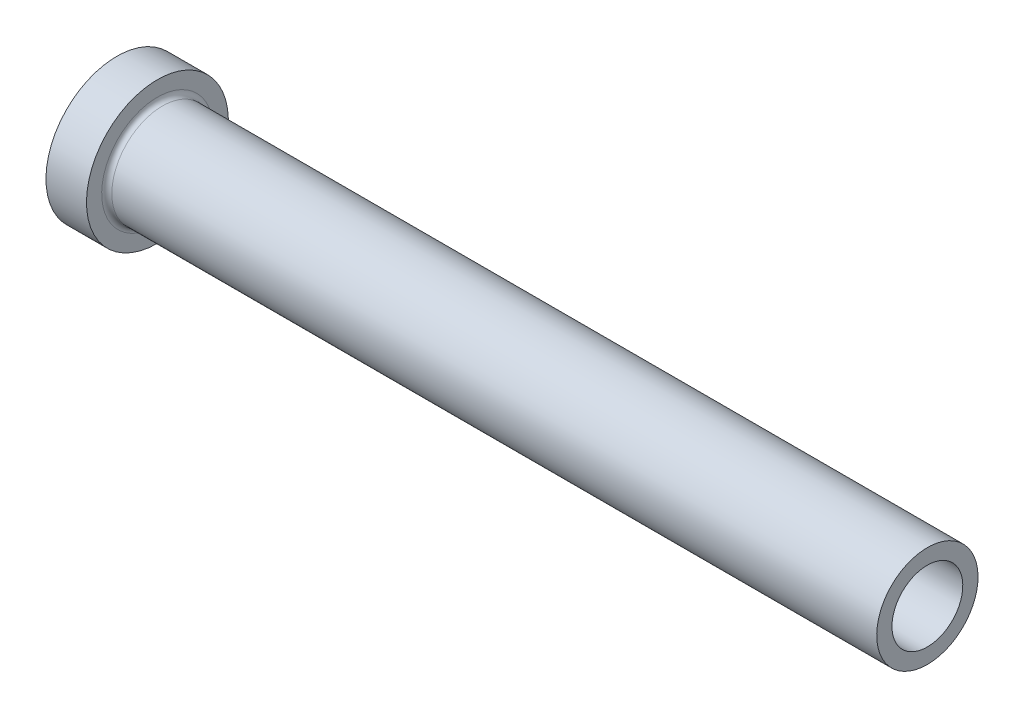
ISO-10303-21;
HEADER;
FILE_DESCRIPTION(('STEP AP214'),'2;1');
FILE_NAME('part.step','',(''),(''),'','','');
FILE_SCHEMA(('AUTOMOTIVE_DESIGN { 1 0 10303 214 1 1 1 1 }'));
ENDSEC;
DATA;
#1=APPLICATION_CONTEXT('core data for automotive mechanical design processes');
#2=APPLICATION_PROTOCOL_DEFINITION('international standard','automotive_design',2000,#1);
#3=PRODUCT_CONTEXT('',#1,'mechanical');
#4=PRODUCT('Part','Part','',(#3));
#5=PRODUCT_RELATED_PRODUCT_CATEGORY('part','',(#4));
#6=PRODUCT_DEFINITION_FORMATION('','',#4);
#7=PRODUCT_DEFINITION_CONTEXT('part definition',#1,'design');
#8=PRODUCT_DEFINITION('design','',#6,#7);
#9=PRODUCT_DEFINITION_SHAPE('','',#8);
#10=(LENGTH_UNIT() NAMED_UNIT(*) SI_UNIT(.MILLI.,.METRE.));
#11=(NAMED_UNIT(*) PLANE_ANGLE_UNIT() SI_UNIT($,.RADIAN.));
#12=(NAMED_UNIT(*) SI_UNIT($,.STERADIAN.) SOLID_ANGLE_UNIT());
#13=UNCERTAINTY_MEASURE_WITH_UNIT(LENGTH_MEASURE(1.E-05),#10,'distance_accuracy_value','');
#14=(GEOMETRIC_REPRESENTATION_CONTEXT(3) GLOBAL_UNCERTAINTY_ASSIGNED_CONTEXT((#13)) GLOBAL_UNIT_ASSIGNED_CONTEXT((#10,
#11,#12)) REPRESENTATION_CONTEXT('',''));
#15=CARTESIAN_POINT('',(0.,0.,0.));
#16=DIRECTION('',(0.,0.,1.));
#17=DIRECTION('',(1.,0.,0.));
#18=AXIS2_PLACEMENT_3D('',#15,#16,#17);
#19=CARTESIAN_POINT('',(126.999999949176,-4.35863998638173,0.));
#20=DIRECTION('',(-1.,0.,0.));
#21=DIRECTION('',(0.,-1.,0.));
#22=AXIS2_PLACEMENT_3D('',#19,#20,#21);
#23=CYLINDRICAL_SURFACE('',#22,11.1125);
#24=CARTESIAN_POINT('',(-5.08240671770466E-08,-4.35863998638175,0.));
#25=DIRECTION('',(-1.,0.,0.));
#26=DIRECTION('',(0.,-1.,0.));
#27=AXIS2_PLACEMENT_3D('',#24,#25,#26);
#28=CIRCLE('',#27,11.1125);
#29=CARTESIAN_POINT('',(-5.08240657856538E-08,-15.4711399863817,0.));
#30=VERTEX_POINT('',#29);
#31=EDGE_CURVE('E62',#30,#30,#28,.T.);
#32=ORIENTED_EDGE('',*,*,#31,.F.);
#33=EDGE_LOOP('',(#32));
#34=FACE_BOUND('',#33,.T.);
#35=CARTESIAN_POINT('',(6.34999994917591,-4.35863998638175,0.));
#36=DIRECTION('',(-1.,0.,0.));
#37=DIRECTION('',(0.,-1.,0.));
#38=AXIS2_PLACEMENT_3D('',#35,#36,#37);
#39=CIRCLE('',#38,11.1125);
#40=CARTESIAN_POINT('',(6.34999994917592,-15.4711399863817,0.));
#41=VERTEX_POINT('',#40);
#42=EDGE_CURVE('E10',#41,#41,#39,.T.);
#43=ORIENTED_EDGE('',*,*,#42,.T.);
#44=EDGE_LOOP('',(#43));
#45=FACE_BOUND('',#44,.T.);
#46=ADVANCED_FACE('F28',(#34,#45),#23,.T.);
#47=CARTESIAN_POINT('',(6.34999994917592,4.37261001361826,0.));
#48=DIRECTION('',(-1.,0.,0.));
#49=DIRECTION('',(0.,-1.,0.));
#50=AXIS2_PLACEMENT_3D('',#47,#48,#49);
#51=PLANE('',#50);
#52=ORIENTED_EDGE('',*,*,#42,.F.);
#53=EDGE_LOOP('',(#52));
#54=FACE_BOUND('',#53,.T.);
#55=CARTESIAN_POINT('',(6.34999994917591,-4.35863998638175,0.));
#56=DIRECTION('',(-1.,0.,0.));
#57=DIRECTION('',(0.,-1.,0.));
#58=AXIS2_PLACEMENT_3D('',#55,#56,#57);
#59=CIRCLE('',#58,8.73125);
#60=CARTESIAN_POINT('',(6.34999994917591,-13.0898899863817,0.));
#61=VERTEX_POINT('',#60);
#62=EDGE_CURVE('E34',#61,#61,#59,.T.);
#63=ORIENTED_EDGE('',*,*,#62,.T.);
#64=EDGE_LOOP('',(#63));
#65=FACE_BOUND('',#64,.T.);
#66=ADVANCED_FACE('F69',(#54,#65),#51,.F.);
#67=CARTESIAN_POINT('',(7.14374994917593,-4.35863998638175,0.));
#68=DIRECTION('',(-1.,0.,0.));
#69=DIRECTION('',(0.,-1.,0.));
#70=AXIS2_PLACEMENT_3D('',#67,#68,#69);
#71=TOROIDAL_SURFACE('',#70,8.73125,0.793750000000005);
#72=ORIENTED_EDGE('',*,*,#62,.F.);
#73=EDGE_LOOP('',(#72));
#74=FACE_BOUND('',#73,.T.);
#75=CARTESIAN_POINT('',(7.14374994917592,-4.35863998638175,0.));
#76=DIRECTION('',(-1.,0.,0.));
#77=DIRECTION('',(0.,-1.,0.));
#78=AXIS2_PLACEMENT_3D('',#75,#76,#77);
#79=CIRCLE('',#78,7.9375);
#80=CARTESIAN_POINT('',(7.14374994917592,-12.2961399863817,0.));
#81=VERTEX_POINT('',#80);
#82=EDGE_CURVE('E38',#81,#81,#79,.T.);
#83=ORIENTED_EDGE('',*,*,#82,.T.);
#84=EDGE_LOOP('',(#83));
#85=FACE_BOUND('',#84,.T.);
#86=ADVANCED_FACE('F73',(#74,#85),#71,.F.);
#87=CARTESIAN_POINT('',(126.999999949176,-4.35863998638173,0.));
#88=DIRECTION('',(-1.,0.,0.));
#89=DIRECTION('',(0.,-1.,0.));
#90=AXIS2_PLACEMENT_3D('',#87,#88,#89);
#91=CYLINDRICAL_SURFACE('',#90,7.9375);
#92=ORIENTED_EDGE('',*,*,#82,.F.);
#93=EDGE_LOOP('',(#92));
#94=FACE_BOUND('',#93,.T.);
#95=CARTESIAN_POINT('',(126.999999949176,-4.35863998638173,0.));
#96=DIRECTION('',(-1.,0.,0.));
#97=DIRECTION('',(0.,-1.,0.));
#98=AXIS2_PLACEMENT_3D('',#95,#96,#97);
#99=CIRCLE('',#98,7.9375);
#100=CARTESIAN_POINT('',(126.999999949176,-12.2961399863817,0.));
#101=VERTEX_POINT('',#100);
#102=EDGE_CURVE('E42',#101,#101,#99,.T.);
#103=ORIENTED_EDGE('',*,*,#102,.T.);
#104=EDGE_LOOP('',(#103));
#105=FACE_BOUND('',#104,.T.);
#106=ADVANCED_FACE('F78',(#94,#105),#91,.T.);
#107=CARTESIAN_POINT('',(126.999999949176,1.19126001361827,0.));
#108=DIRECTION('',(-1.,0.,0.));
#109=DIRECTION('',(0.,-1.,0.));
#110=AXIS2_PLACEMENT_3D('',#107,#108,#109);
#111=PLANE('',#110);
#112=ORIENTED_EDGE('',*,*,#102,.F.);
#113=EDGE_LOOP('',(#112));
#114=FACE_BOUND('',#113,.T.);
#115=CARTESIAN_POINT('',(126.999999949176,-4.35863998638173,0.));
#116=DIRECTION('',(-1.,0.,0.));
#117=DIRECTION('',(0.,-1.,0.));
#118=AXIS2_PLACEMENT_3D('',#115,#116,#117);
#119=CIRCLE('',#118,5.5499);
#120=CARTESIAN_POINT('',(126.999999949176,-9.90853998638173,0.));
#121=VERTEX_POINT('',#120);
#122=EDGE_CURVE('E47',#121,#121,#119,.T.);
#123=ORIENTED_EDGE('',*,*,#122,.T.);
#124=EDGE_LOOP('',(#123));
#125=FACE_BOUND('',#124,.T.);
#126=ADVANCED_FACE('F84',(#114,#125),#111,.F.);
#127=CARTESIAN_POINT('',(126.999999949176,-4.35863998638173,0.));
#128=DIRECTION('',(-1.,0.,0.));
#129=DIRECTION('',(0.,-1.,0.));
#130=AXIS2_PLACEMENT_3D('',#127,#128,#129);
#131=CYLINDRICAL_SURFACE('',#130,5.5499);
#132=ORIENTED_EDGE('',*,*,#122,.F.);
#133=EDGE_LOOP('',(#132));
#134=FACE_BOUND('',#133,.T.);
#135=CARTESIAN_POINT('',(69.8499999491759,-4.35863998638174,0.));
#136=DIRECTION('',(-1.,0.,0.));
#137=DIRECTION('',(0.,-1.,0.));
#138=AXIS2_PLACEMENT_3D('',#135,#136,#137);
#139=CIRCLE('',#138,5.54990000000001);
#140=CARTESIAN_POINT('',(69.8499999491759,-9.90853998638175,0.));
#141=VERTEX_POINT('',#140);
#142=EDGE_CURVE('E50',#141,#141,#139,.T.);
#143=ORIENTED_EDGE('',*,*,#142,.T.);
#144=EDGE_LOOP('',(#143));
#145=FACE_BOUND('',#144,.T.);
#146=ADVANCED_FACE('F88',(#134,#145),#131,.F.);
#147=CARTESIAN_POINT('',(69.109421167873,-4.35863998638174,0.));
#148=DIRECTION('',(-1.,0.,0.));
#149=DIRECTION('',(0.,-1.,0.));
#150=AXIS2_PLACEMENT_3D('',#147,#148,#149);
#151=CONICAL_SURFACE('',#150,5.74833748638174,0.261799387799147);
#152=ORIENTED_EDGE('',*,*,#142,.F.);
#153=EDGE_LOOP('',(#152));
#154=FACE_BOUND('',#153,.T.);
#155=CARTESIAN_POINT('',(69.109421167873,-4.35863998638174,0.));
#156=DIRECTION('',(-1.,0.,0.));
#157=DIRECTION('',(0.,-1.,0.));
#158=AXIS2_PLACEMENT_3D('',#155,#156,#157);
#159=CIRCLE('',#158,5.74833748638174);
#160=CARTESIAN_POINT('',(69.109421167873,-10.1069774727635,0.));
#161=VERTEX_POINT('',#160);
#162=EDGE_CURVE('E53',#161,#161,#159,.T.);
#163=ORIENTED_EDGE('',*,*,#162,.T.);
#164=EDGE_LOOP('',(#163));
#165=FACE_BOUND('',#164,.T.);
#166=ADVANCED_FACE('F92',(#154,#165),#151,.F.);
#167=CARTESIAN_POINT('',(126.999999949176,-4.35863998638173,0.));
#168=DIRECTION('',(-1.,0.,0.));
#169=DIRECTION('',(0.,-1.,0.));
#170=AXIS2_PLACEMENT_3D('',#167,#168,#169);
#171=CYLINDRICAL_SURFACE('',#170,5.74833748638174);
#172=ORIENTED_EDGE('',*,*,#162,.F.);
#173=EDGE_LOOP('',(#172));
#174=FACE_BOUND('',#173,.T.);
#175=CARTESIAN_POINT('',(1.19062494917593,-4.35863998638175,0.));
#176=DIRECTION('',(-1.,0.,0.));
#177=DIRECTION('',(0.,-1.,0.));
#178=AXIS2_PLACEMENT_3D('',#175,#176,#177);
#179=CIRCLE('',#178,5.74833748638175);
#180=CARTESIAN_POINT('',(1.19062494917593,-10.1069774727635,0.));
#181=VERTEX_POINT('',#180);
#182=EDGE_CURVE('E56',#181,#181,#179,.T.);
#183=ORIENTED_EDGE('',*,*,#182,.T.);
#184=EDGE_LOOP('',(#183));
#185=FACE_BOUND('',#184,.T.);
#186=ADVANCED_FACE('F96',(#174,#185),#171,.F.);
#187=CARTESIAN_POINT('',(-5.08240671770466E-08,-4.35863998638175,0.));
#188=DIRECTION('',(-1.,0.,0.));
#189=DIRECTION('',(0.,-1.,0.));
#190=AXIS2_PLACEMENT_3D('',#187,#188,#189);
#191=CONICAL_SURFACE('',#190,6.93896250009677,0.785398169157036);
#192=ORIENTED_EDGE('',*,*,#182,.F.);
#193=EDGE_LOOP('',(#192));
#194=FACE_BOUND('',#193,.T.);
#195=CARTESIAN_POINT('',(-5.08240671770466E-08,-4.35863998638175,0.));
#196=DIRECTION('',(-1.,0.,0.));
#197=DIRECTION('',(0.,-1.,0.));
#198=AXIS2_PLACEMENT_3D('',#195,#196,#197);
#199=CIRCLE('',#198,6.93896250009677);
#200=CARTESIAN_POINT('',(-5.08240663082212E-08,-11.2976024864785,0.));
#201=VERTEX_POINT('',#200);
#202=EDGE_CURVE('E59',#201,#201,#199,.T.);
#203=ORIENTED_EDGE('',*,*,#202,.T.);
#204=EDGE_LOOP('',(#203));
#205=FACE_BOUND('',#204,.T.);
#206=ADVANCED_FACE('F100',(#194,#205),#191,.F.);
#207=CARTESIAN_POINT('',(-5.08240735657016E-08,6.75386001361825,0.));
#208=DIRECTION('',(1.,0.,0.));
#209=DIRECTION('',(0.,1.,0.));
#210=AXIS2_PLACEMENT_3D('',#207,#208,#209);
#211=PLANE('',#210);
#212=ORIENTED_EDGE('',*,*,#202,.F.);
#213=EDGE_LOOP('',(#212));
#214=FACE_BOUND('',#213,.T.);
#215=ORIENTED_EDGE('',*,*,#31,.T.);
#216=EDGE_LOOP('',(#215));
#217=FACE_BOUND('',#216,.T.);
#218=ADVANCED_FACE('F66',(#214,#217),#211,.F.);
#219=CLOSED_SHELL('',(#46,#66,#86,#106,#126,#146,#166,#186,#206,#218));
#220=MANIFOLD_SOLID_BREP('B2',#219);
#221=ADVANCED_BREP_SHAPE_REPRESENTATION('',(#18,#220),#14);
#222=SHAPE_DEFINITION_REPRESENTATION(#9,#221);
ENDSEC;
END-ISO-10303-21;
